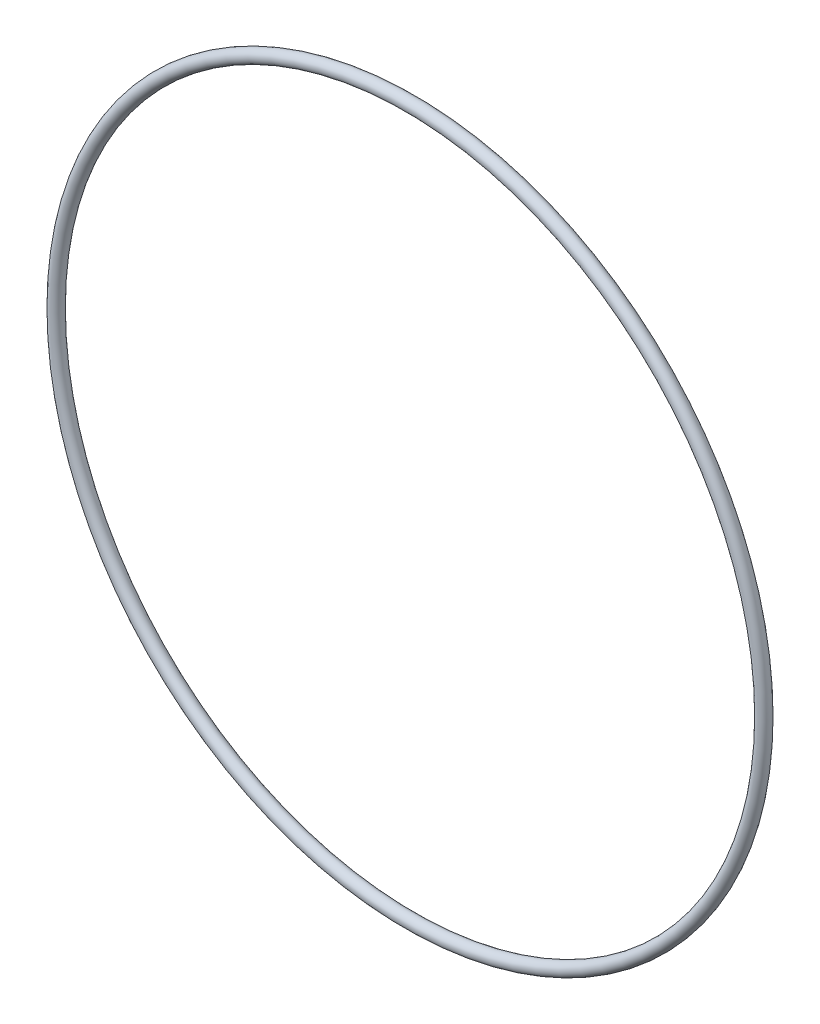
ISO-10303-21;
HEADER;
FILE_DESCRIPTION(('STEP AP214'),'2;1');
FILE_NAME('part.step','',(''),(''),'','','');
FILE_SCHEMA(('AUTOMOTIVE_DESIGN { 1 0 10303 214 1 1 1 1 }'));
ENDSEC;
DATA;
#1=APPLICATION_CONTEXT('core data for automotive mechanical design processes');
#2=APPLICATION_PROTOCOL_DEFINITION('international standard','automotive_design',2000,#1);
#3=PRODUCT_CONTEXT('',#1,'mechanical');
#4=PRODUCT('Part','Part','',(#3));
#5=PRODUCT_RELATED_PRODUCT_CATEGORY('part','',(#4));
#6=PRODUCT_DEFINITION_FORMATION('','',#4);
#7=PRODUCT_DEFINITION_CONTEXT('part definition',#1,'design');
#8=PRODUCT_DEFINITION('design','',#6,#7);
#9=PRODUCT_DEFINITION_SHAPE('','',#8);
#10=(LENGTH_UNIT() NAMED_UNIT(*) SI_UNIT(.MILLI.,.METRE.));
#11=(NAMED_UNIT(*) PLANE_ANGLE_UNIT() SI_UNIT($,.RADIAN.));
#12=(NAMED_UNIT(*) SI_UNIT($,.STERADIAN.) SOLID_ANGLE_UNIT());
#13=UNCERTAINTY_MEASURE_WITH_UNIT(LENGTH_MEASURE(1.E-05),#10,'distance_accuracy_value','');
#14=(GEOMETRIC_REPRESENTATION_CONTEXT(3) GLOBAL_UNCERTAINTY_ASSIGNED_CONTEXT((#13)) GLOBAL_UNIT_ASSIGNED_CONTEXT((#10,
#11,#12)) REPRESENTATION_CONTEXT('',''));
#15=CARTESIAN_POINT('',(0.,0.,0.));
#16=DIRECTION('',(0.,0.,1.));
#17=DIRECTION('',(1.,0.,0.));
#18=AXIS2_PLACEMENT_3D('',#15,#16,#17);
#19=CARTESIAN_POINT('',(0.,0.,0.));
#20=DIRECTION('',(0.,0.,1.));
#21=DIRECTION('',(1.,0.,0.));
#22=AXIS2_PLACEMENT_3D('',#19,#20,#21);
#23=TOROIDAL_SURFACE('',#22,326.,5.99999999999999);
#24=CARTESIAN_POINT('',(-326.,0.,0.));
#25=DIRECTION('',(0.,1.,0.));
#26=DIRECTION('',(0.,0.,1.));
#27=AXIS2_PLACEMENT_3D('',#24,#25,#26);
#28=CIRCLE('',#27,5.99999999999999);
#29=CARTESIAN_POINT('',(-332.,0.,0.));
#30=VERTEX_POINT('',#29);
#31=EDGE_CURVE('E10',#30,#30,#28,.T.);
#32=CARTESIAN_POINT('',(0.,0.,0.));
#33=DIRECTION('',(0.,0.,1.));
#34=DIRECTION('',(1.,0.,0.));
#35=AXIS2_PLACEMENT_3D('',#32,#33,#34);
#36=CIRCLE('',#35,332.);
#37=EDGE_CURVE('',#30,#30,#36,.T.);
#38=ORIENTED_EDGE('',*,*,#31,.F.);
#39=ORIENTED_EDGE('',*,*,#31,.T.);
#40=ORIENTED_EDGE('',*,*,#37,.T.);
#41=ORIENTED_EDGE('',*,*,#37,.F.);
#42=EDGE_LOOP('',(#38,#40,#39,#41));
#43=FACE_BOUND('',#42,.T.);
#44=ADVANCED_FACE('F41',(#43),#23,.T.);
#45=CLOSED_SHELL('',(#44));
#46=MANIFOLD_SOLID_BREP('B2',#45);
#47=ADVANCED_BREP_SHAPE_REPRESENTATION('',(#18,#46),#14);
#48=SHAPE_DEFINITION_REPRESENTATION(#9,#47);
ENDSEC;
END-ISO-10303-21;
